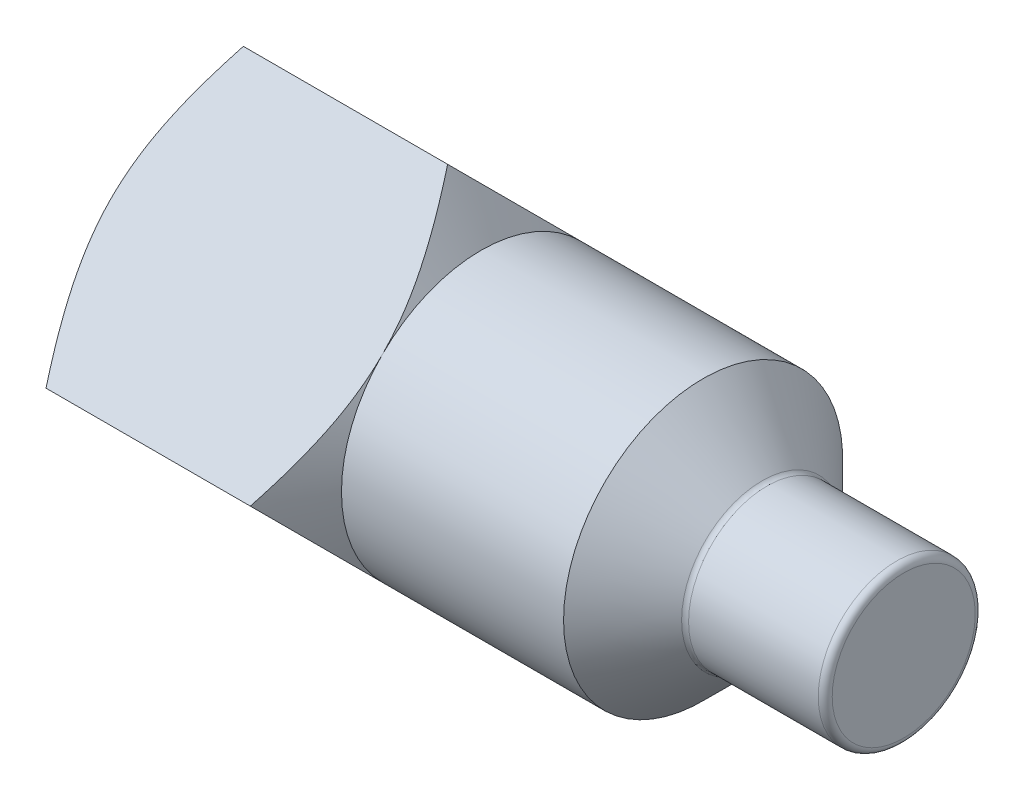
ISO-10303-21;
HEADER;
FILE_DESCRIPTION(('STEP AP214'),'2;1');
FILE_NAME('part.step','',(''),(''),'','','');
FILE_SCHEMA(('AUTOMOTIVE_DESIGN { 1 0 10303 214 1 1 1 1 }'));
ENDSEC;
DATA;
#1=APPLICATION_CONTEXT('core data for automotive mechanical design processes');
#2=APPLICATION_PROTOCOL_DEFINITION('international standard','automotive_design',2000,#1);
#3=PRODUCT_CONTEXT('',#1,'mechanical');
#4=PRODUCT('Part','Part','',(#3));
#5=PRODUCT_RELATED_PRODUCT_CATEGORY('part','',(#4));
#6=PRODUCT_DEFINITION_FORMATION('','',#4);
#7=PRODUCT_DEFINITION_CONTEXT('part definition',#1,'design');
#8=PRODUCT_DEFINITION('design','',#6,#7);
#9=PRODUCT_DEFINITION_SHAPE('','',#8);
#10=(LENGTH_UNIT() NAMED_UNIT(*) SI_UNIT(.MILLI.,.METRE.));
#11=(NAMED_UNIT(*) PLANE_ANGLE_UNIT() SI_UNIT($,.RADIAN.));
#12=(NAMED_UNIT(*) SI_UNIT($,.STERADIAN.) SOLID_ANGLE_UNIT());
#13=UNCERTAINTY_MEASURE_WITH_UNIT(LENGTH_MEASURE(1.E-05),#10,'distance_accuracy_value','');
#14=(GEOMETRIC_REPRESENTATION_CONTEXT(3) GLOBAL_UNCERTAINTY_ASSIGNED_CONTEXT((#13)) GLOBAL_UNIT_ASSIGNED_CONTEXT((#10,
#11,#12)) REPRESENTATION_CONTEXT('',''));
#15=CARTESIAN_POINT('',(0.,0.,0.));
#16=DIRECTION('',(0.,0.,1.));
#17=DIRECTION('',(1.,0.,0.));
#18=AXIS2_PLACEMENT_3D('',#15,#16,#17);
#19=CARTESIAN_POINT('',(0.,0.,0.));
#20=DIRECTION('',(-1.,0.,0.));
#21=DIRECTION('',(0.,0.,1.));
#22=AXIS2_PLACEMENT_3D('',#19,#20,#21);
#23=CYLINDRICAL_SURFACE('',#22,2.);
#24=CARTESIAN_POINT('',(3.94226497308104,0.,0.));
#25=DIRECTION('',(-1.,0.,0.));
#26=DIRECTION('',(0.,0.,1.));
#27=AXIS2_PLACEMENT_3D('',#24,#25,#26);
#28=CIRCLE('',#27,2.);
#29=CARTESIAN_POINT('',(3.9422649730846,1.41421356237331,1.41421356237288));
#30=VERTEX_POINT('',#29);
#31=CARTESIAN_POINT('',(3.94226497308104,1.41421356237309,-1.4142135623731));
#32=VERTEX_POINT('',#31);
#33=EDGE_CURVE('E53',#30,#32,#28,.T.);
#34=ORIENTED_EDGE('',*,*,#33,.F.);
#35=CARTESIAN_POINT('',(3.94226497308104,-1.41421356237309,1.4142135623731));
#36=VERTEX_POINT('',#35);
#37=EDGE_CURVE('E94',#36,#30,#28,.T.);
#38=ORIENTED_EDGE('',*,*,#37,.F.);
#39=CARTESIAN_POINT('',(3.94226497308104,-1.41421356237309,-1.4142135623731));
#40=VERTEX_POINT('',#39);
#41=EDGE_CURVE('E93',#40,#36,#28,.T.);
#42=ORIENTED_EDGE('',*,*,#41,.F.);
#43=EDGE_CURVE('E110',#32,#40,#28,.T.);
#44=ORIENTED_EDGE('',*,*,#43,.F.);
#45=EDGE_LOOP('',(#34,#38,#42,#44));
#46=FACE_BOUND('',#45,.T.);
#47=CARTESIAN_POINT('',(7.12499999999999,0.,0.));
#48=DIRECTION('',(-1.,0.,0.));
#49=DIRECTION('',(0.,0.,1.));
#50=AXIS2_PLACEMENT_3D('',#47,#48,#49);
#51=CIRCLE('',#50,2.);
#52=CARTESIAN_POINT('',(7.12499999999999,0.,2.));
#53=VERTEX_POINT('',#52);
#54=EDGE_CURVE('E165',#53,#53,#51,.T.);
#55=ORIENTED_EDGE('',*,*,#54,.T.);
#56=EDGE_LOOP('',(#55));
#57=FACE_BOUND('',#56,.T.);
#58=ADVANCED_FACE('F39',(#46,#57),#23,.T.);
#59=CARTESIAN_POINT('',(3.46397234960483,0.,0.));
#60=DIRECTION('',(-1.,0.,0.));
#61=DIRECTION('',(0.,0.,1.));
#62=AXIS2_PLACEMENT_3D('',#59,#60,#61);
#63=CONICAL_SURFACE('',#62,2.82842712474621,1.0471975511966);
#64=CARTESIAN_POINT('',(3.4638568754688,2.8286271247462,-0.000200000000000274));
#65=CARTESIAN_POINT('',(3.49161506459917,2.78053478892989,0.0478923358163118));
#66=CARTESIAN_POINT('',(3.51878504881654,2.7322683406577,0.0961587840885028));
#67=CARTESIAN_POINT('',(3.57167045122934,2.63532015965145,0.193106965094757));
#68=CARTESIAN_POINT('',(3.59738536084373,2.58663828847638,0.241788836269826));
#69=CARTESIAN_POINT('',(3.64721601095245,2.48852382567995,0.339903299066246));
#70=CARTESIAN_POINT('',(3.67132090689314,2.43908845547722,0.389338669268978));
#71=CARTESIAN_POINT('',(3.71737604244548,2.33972512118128,0.488702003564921));
#72=CARTESIAN_POINT('',(3.73932646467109,2.28979719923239,0.538629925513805));
#73=CARTESIAN_POINT('',(3.8006124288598,2.14090389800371,0.687523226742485));
#74=CARTESIAN_POINT('',(3.83626445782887,2.04114820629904,0.787278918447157));
#75=CARTESIAN_POINT('',(3.89354790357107,1.83980995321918,0.988617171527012));
#76=CARTESIAN_POINT('',(3.91521440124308,1.73823262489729,1.0901944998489));
#77=CARTESIAN_POINT('',(3.93895616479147,1.55061877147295,1.27780835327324));
#78=CARTESIAN_POINT('',(3.94365263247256,1.46475280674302,1.36367431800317));
#79=CARTESIAN_POINT('',(3.94015885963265,1.29311675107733,1.53531037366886));
#80=CARTESIAN_POINT('',(3.93196285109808,1.20734672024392,1.62108040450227));
#81=CARTESIAN_POINT('',(3.90378450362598,1.03666151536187,1.79176560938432));
#82=CARTESIAN_POINT('',(3.88378039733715,0.951748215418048,1.87667890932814));
#83=CARTESIAN_POINT('',(3.83421705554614,0.783348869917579,2.04507825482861));
#84=CARTESIAN_POINT('',(3.80465560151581,0.699863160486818,2.12856396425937));
#85=CARTESIAN_POINT('',(3.75037319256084,0.564467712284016,2.26395941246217));
#86=CARTESIAN_POINT('',(3.72780043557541,0.512114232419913,2.31631289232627));
#87=CARTESIAN_POINT('',(3.68024330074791,0.407975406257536,2.42045171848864));
#88=CARTESIAN_POINT('',(3.65525964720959,0.356189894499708,2.47223723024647));
#89=CARTESIAN_POINT('',(3.60344889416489,0.253386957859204,2.57504016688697));
#90=CARTESIAN_POINT('',(3.57663195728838,0.202366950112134,2.62606017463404));
#91=CARTESIAN_POINT('',(3.52137669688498,0.100767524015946,2.72765960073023));
#92=CARTESIAN_POINT('',(3.49293839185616,0.0501881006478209,2.77823902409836));
#93=CARTESIAN_POINT('',(3.46385687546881,-0.000200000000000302,2.82862712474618));
#94=B_SPLINE_CURVE_WITH_KNOTS('',3,(#64,#65,#66,#67,#68,#69,#70,#71,#72,#73,#74,#75,#76,#77,#78,
#79,#80,#81,#82,#83,#84,#85,#86,#87,#88,#89,#90,#91,#92,#93),.UNSPECIFIED.,.F.,.F.,(4,2,2,2,2,2,
2,2,2,2,2,2,2,2,4),(0.,0.220383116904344,0.440842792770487,0.662662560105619,0.884463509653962,
1.32047426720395,1.75538705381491,2.11928790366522,2.48335160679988,2.84808853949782,
3.21291019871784,3.4450819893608,3.67718424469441,3.90809048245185,4.13899408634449),.UNSPECIFIED.);
#95=CARTESIAN_POINT('',(3.46397234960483,2.82842712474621,0.));
#96=VERTEX_POINT('',#95);
#97=EDGE_CURVE('E118',#96,#30,#94,.T.);
#98=ORIENTED_EDGE('',*,*,#97,.T.);
#99=ORIENTED_EDGE('',*,*,#33,.T.);
#100=CARTESIAN_POINT('',(3.46385687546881,-0.000200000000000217,-2.82862712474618));
#101=CARTESIAN_POINT('',(3.49161506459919,0.0478923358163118,-2.78053478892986));
#102=CARTESIAN_POINT('',(3.51878504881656,0.0961587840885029,-2.73226834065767));
#103=CARTESIAN_POINT('',(3.57167045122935,0.193106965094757,-2.63532015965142));
#104=CARTESIAN_POINT('',(3.59738536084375,0.241788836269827,-2.58663828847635));
#105=CARTESIAN_POINT('',(3.64721601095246,0.339903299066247,-2.48852382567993));
#106=CARTESIAN_POINT('',(3.67132090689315,0.389338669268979,-2.4390884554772));
#107=CARTESIAN_POINT('',(3.71737604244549,0.488702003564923,-2.33972512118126));
#108=CARTESIAN_POINT('',(3.7393264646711,0.538629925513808,-2.28979719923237));
#109=CARTESIAN_POINT('',(3.80061242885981,0.687523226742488,-2.1409038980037));
#110=CARTESIAN_POINT('',(3.83626445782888,0.78727891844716,-2.04114820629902));
#111=CARTESIAN_POINT('',(3.89354790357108,0.988617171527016,-1.83980995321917));
#112=CARTESIAN_POINT('',(3.91521440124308,1.0901944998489,-1.73823262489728));
#113=CARTESIAN_POINT('',(3.93895616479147,1.27780835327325,-1.55061877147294));
#114=CARTESIAN_POINT('',(3.94365263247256,1.36367431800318,-1.46475280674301));
#115=CARTESIAN_POINT('',(3.94015885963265,1.53531037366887,-1.29311675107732));
#116=CARTESIAN_POINT('',(3.93196285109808,1.62108040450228,-1.20734672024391));
#117=CARTESIAN_POINT('',(3.90378450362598,1.79176560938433,-1.03666151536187));
#118=CARTESIAN_POINT('',(3.88378039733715,1.87667890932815,-0.951748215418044));
#119=CARTESIAN_POINT('',(3.83421705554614,2.04507825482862,-0.783348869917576));
#120=CARTESIAN_POINT('',(3.8046556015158,2.12856396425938,-0.699863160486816));
#121=CARTESIAN_POINT('',(3.75037319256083,2.26395941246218,-0.564467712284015));
#122=CARTESIAN_POINT('',(3.7278004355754,2.31631289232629,-0.512114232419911));
#123=CARTESIAN_POINT('',(3.6802433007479,2.42045171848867,-0.407975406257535));
#124=CARTESIAN_POINT('',(3.65525964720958,2.47223723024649,-0.356189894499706));
#125=CARTESIAN_POINT('',(3.60344889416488,2.575040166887,-0.253386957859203));
#126=CARTESIAN_POINT('',(3.57663195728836,2.62606017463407,-0.202366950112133));
#127=CARTESIAN_POINT('',(3.52137669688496,2.72765960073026,-0.100767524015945));
#128=CARTESIAN_POINT('',(3.49293839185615,2.77823902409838,-0.0501881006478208));
#129=CARTESIAN_POINT('',(3.4638568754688,2.8286271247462,0.000200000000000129));
#130=B_SPLINE_CURVE_WITH_KNOTS('',3,(#100,#101,#102,#103,#104,#105,#106,#107,#108,#109,#110,
#111,#112,#113,#114,#115,#116,#117,#118,#119,#120,#121,#122,#123,#124,#125,#126,#127,#128,#129),
.UNSPECIFIED.,.F.,.F.,(4,2,2,2,2,2,2,2,2,2,2,2,2,2,4),(0.,0.220383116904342,0.440842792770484,
0.662662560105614,0.884463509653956,1.32047426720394,1.75538705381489,2.11928790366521,
2.48335160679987,2.84808853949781,3.21291019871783,3.4450819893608,3.67718424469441,
3.90809048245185,4.13899408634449),.UNSPECIFIED.);
#131=EDGE_CURVE('E161',#32,#96,#130,.T.);
#132=ORIENTED_EDGE('',*,*,#131,.T.);
#133=EDGE_LOOP('',(#98,#99,#132));
#134=FACE_BOUND('',#133,.T.);
#135=ADVANCED_FACE('F142',(#134),#63,.T.);
#136=CARTESIAN_POINT('',(3.46397234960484,0.,-2.82842712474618));
#137=VERTEX_POINT('',#136);
#138=EDGE_CURVE('E154',#137,#32,#130,.T.);
#139=ORIENTED_EDGE('',*,*,#138,.T.);
#140=ORIENTED_EDGE('',*,*,#43,.T.);
#141=CARTESIAN_POINT('',(3.4638568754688,-2.8286271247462,0.000199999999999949));
#142=CARTESIAN_POINT('',(3.49161506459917,-2.78053478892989,-0.0478923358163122));
#143=CARTESIAN_POINT('',(3.51878504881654,-2.7322683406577,-0.0961587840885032));
#144=CARTESIAN_POINT('',(3.57167045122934,-2.63532015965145,-0.193106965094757));
#145=CARTESIAN_POINT('',(3.59738536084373,-2.58663828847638,-0.241788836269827));
#146=CARTESIAN_POINT('',(3.64721601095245,-2.48852382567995,-0.339903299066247));
#147=CARTESIAN_POINT('',(3.67132090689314,-2.43908845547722,-0.389338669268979));
#148=CARTESIAN_POINT('',(3.71737604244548,-2.33972512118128,-0.488702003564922));
#149=CARTESIAN_POINT('',(3.73932646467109,-2.28979719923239,-0.538629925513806));
#150=CARTESIAN_POINT('',(3.8006124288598,-2.14090389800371,-0.687523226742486));
#151=CARTESIAN_POINT('',(3.83626445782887,-2.04114820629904,-0.787278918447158));
#152=CARTESIAN_POINT('',(3.89354790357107,-1.83980995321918,-0.988617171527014));
#153=CARTESIAN_POINT('',(3.91521440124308,-1.73823262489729,-1.0901944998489));
#154=CARTESIAN_POINT('',(3.93895616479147,-1.55061877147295,-1.27780835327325));
#155=CARTESIAN_POINT('',(3.94365263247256,-1.46475280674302,-1.36367431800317));
#156=CARTESIAN_POINT('',(3.94015885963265,-1.29311675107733,-1.53531037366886));
#157=CARTESIAN_POINT('',(3.93196285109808,-1.20734672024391,-1.62108040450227));
#158=CARTESIAN_POINT('',(3.90378450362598,-1.03666151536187,-1.79176560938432));
#159=CARTESIAN_POINT('',(3.88378039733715,-0.951748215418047,-1.87667890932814));
#160=CARTESIAN_POINT('',(3.83421705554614,-0.783348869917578,-2.04507825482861));
#161=CARTESIAN_POINT('',(3.80465560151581,-0.699863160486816,-2.12856396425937));
#162=CARTESIAN_POINT('',(3.75037319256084,-0.564467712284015,-2.26395941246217));
#163=CARTESIAN_POINT('',(3.72780043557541,-0.512114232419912,-2.31631289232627));
#164=CARTESIAN_POINT('',(3.68024330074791,-0.407975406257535,-2.42045171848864));
#165=CARTESIAN_POINT('',(3.65525964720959,-0.356189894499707,-2.47223723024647));
#166=CARTESIAN_POINT('',(3.60344889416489,-0.253386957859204,-2.57504016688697));
#167=CARTESIAN_POINT('',(3.57663195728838,-0.202366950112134,-2.62606017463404));
#168=CARTESIAN_POINT('',(3.52137669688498,-0.100767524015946,-2.72765960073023));
#169=CARTESIAN_POINT('',(3.49293839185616,-0.0501881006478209,-2.77823902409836));
#170=CARTESIAN_POINT('',(3.46385687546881,0.000200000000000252,-2.82862712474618));
#171=B_SPLINE_CURVE_WITH_KNOTS('',3,(#141,#142,#143,#144,#145,#146,#147,#148,#149,#150,#151,
#152,#153,#154,#155,#156,#157,#158,#159,#160,#161,#162,#163,#164,#165,#166,#167,#168,#169,#170),
.UNSPECIFIED.,.F.,.F.,(4,2,2,2,2,2,2,2,2,2,2,2,2,2,4),(0.,0.220383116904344,0.440842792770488,
0.66266256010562,0.884463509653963,1.32047426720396,1.75538705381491,2.11928790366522,
2.48335160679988,2.84808853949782,3.21291019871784,3.44508198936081,3.67718424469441,
3.90809048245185,4.13899408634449),.UNSPECIFIED.);
#172=EDGE_CURVE('E64',#40,#137,#171,.T.);
#173=ORIENTED_EDGE('',*,*,#172,.T.);
#174=EDGE_LOOP('',(#139,#140,#173));
#175=FACE_BOUND('',#174,.T.);
#176=ADVANCED_FACE('F147',(#175),#63,.T.);
#177=CARTESIAN_POINT('',(3.46397234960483,-2.82842712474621,0.));
#178=VERTEX_POINT('',#177);
#179=EDGE_CURVE('E106',#178,#40,#171,.T.);
#180=ORIENTED_EDGE('',*,*,#179,.T.);
#181=ORIENTED_EDGE('',*,*,#41,.T.);
#182=CARTESIAN_POINT('',(3.46385687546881,0.000199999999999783,2.82862712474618));
#183=CARTESIAN_POINT('',(3.49161506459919,-0.0478923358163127,2.78053478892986));
#184=CARTESIAN_POINT('',(3.51878504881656,-0.0961587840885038,2.73226834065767));
#185=CARTESIAN_POINT('',(3.57167045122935,-0.193106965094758,2.63532015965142));
#186=CARTESIAN_POINT('',(3.59738536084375,-0.241788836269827,2.58663828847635));
#187=CARTESIAN_POINT('',(3.64721601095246,-0.339903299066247,2.48852382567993));
#188=CARTESIAN_POINT('',(3.67132090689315,-0.38933866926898,2.4390884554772));
#189=CARTESIAN_POINT('',(3.71737604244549,-0.488702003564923,2.33972512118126));
#190=CARTESIAN_POINT('',(3.7393264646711,-0.538629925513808,2.28979719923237));
#191=CARTESIAN_POINT('',(3.80061242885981,-0.687523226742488,2.1409038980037));
#192=CARTESIAN_POINT('',(3.83626445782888,-0.787278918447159,2.04114820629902));
#193=CARTESIAN_POINT('',(3.89354790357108,-0.988617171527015,1.83980995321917));
#194=CARTESIAN_POINT('',(3.91521440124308,-1.0901944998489,1.73823262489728));
#195=CARTESIAN_POINT('',(3.93895616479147,-1.27780835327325,1.55061877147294));
#196=CARTESIAN_POINT('',(3.94365263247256,-1.36367431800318,1.46475280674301));
#197=CARTESIAN_POINT('',(3.94015885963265,-1.53531037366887,1.29311675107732));
#198=CARTESIAN_POINT('',(3.93196285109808,-1.62108040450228,1.20734672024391));
#199=CARTESIAN_POINT('',(3.90378450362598,-1.79176560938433,1.03666151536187));
#200=CARTESIAN_POINT('',(3.88378039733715,-1.87667890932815,0.951748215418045));
#201=CARTESIAN_POINT('',(3.83421705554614,-2.04507825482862,0.783348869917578));
#202=CARTESIAN_POINT('',(3.8046556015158,-2.12856396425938,0.699863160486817));
#203=CARTESIAN_POINT('',(3.75037319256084,-2.26395941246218,0.564467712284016));
#204=CARTESIAN_POINT('',(3.7278004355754,-2.31631289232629,0.512114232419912));
#205=CARTESIAN_POINT('',(3.6802433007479,-2.42045171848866,0.407975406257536));
#206=CARTESIAN_POINT('',(3.65525964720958,-2.47223723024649,0.356189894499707));
#207=CARTESIAN_POINT('',(3.60344889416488,-2.575040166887,0.253386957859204));
#208=CARTESIAN_POINT('',(3.57663195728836,-2.62606017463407,0.202366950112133));
#209=CARTESIAN_POINT('',(3.52137669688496,-2.72765960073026,0.100767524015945));
#210=CARTESIAN_POINT('',(3.49293839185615,-2.77823902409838,0.0501881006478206));
#211=CARTESIAN_POINT('',(3.4638568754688,-2.8286271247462,-0.000200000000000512));
#212=B_SPLINE_CURVE_WITH_KNOTS('',3,(#182,#183,#184,#185,#186,#187,#188,#189,#190,#191,#192,
#193,#194,#195,#196,#197,#198,#199,#200,#201,#202,#203,#204,#205,#206,#207,#208,#209,#210,#211),
.UNSPECIFIED.,.F.,.F.,(4,2,2,2,2,2,2,2,2,2,2,2,2,2,4),(0.,0.220383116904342,0.440842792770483,
0.662662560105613,0.884463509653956,1.32047426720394,1.75538705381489,2.1192879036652,
2.48335160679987,2.8480885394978,3.21291019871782,3.4450819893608,3.67718424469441,
3.90809048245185,4.13899408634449),.UNSPECIFIED.);
#213=EDGE_CURVE('E104',#36,#178,#212,.T.);
#214=ORIENTED_EDGE('',*,*,#213,.T.);
#215=EDGE_LOOP('',(#180,#181,#214));
#216=FACE_BOUND('',#215,.T.);
#217=ADVANCED_FACE('F101',(#216),#63,.T.);
#218=CARTESIAN_POINT('',(3.46397234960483,0.,2.82842712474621));
#219=VERTEX_POINT('',#218);
#220=EDGE_CURVE('E115',#219,#36,#212,.T.);
#221=ORIENTED_EDGE('',*,*,#220,.T.);
#222=ORIENTED_EDGE('',*,*,#37,.T.);
#223=EDGE_CURVE('E117',#30,#219,#94,.T.);
#224=ORIENTED_EDGE('',*,*,#223,.T.);
#225=EDGE_LOOP('',(#221,#222,#224));
#226=FACE_BOUND('',#225,.T.);
#227=ADVANCED_FACE('F120',(#226),#63,.T.);
#228=CARTESIAN_POINT('',(4.,2.8284271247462,0.));
#229=DIRECTION('',(0.,-0.707106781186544,-0.707106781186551));
#230=DIRECTION('',(0.,0.707106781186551,-0.707106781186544));
#231=AXIS2_PLACEMENT_3D('',#228,#229,#230);
#232=PLANE('',#231);
#233=ORIENTED_EDGE('',*,*,#223,.F.);
#234=ORIENTED_EDGE('',*,*,#97,.F.);
#235=DIRECTION('',(-1.,0.,0.));
#236=VECTOR('',#235,1.);
#237=CARTESIAN_POINT('',(4.,2.8284271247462,0.));
#238=LINE('',#237,#236);
#239=CARTESIAN_POINT('',(0.536027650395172,2.8284271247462,0.));
#240=VERTEX_POINT('',#239);
#241=EDGE_CURVE('E205',#96,#240,#238,.T.);
#242=ORIENTED_EDGE('',*,*,#241,.T.);
#243=CARTESIAN_POINT('',(0.536143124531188,-0.000200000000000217,2.82862712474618));
#244=CARTESIAN_POINT('',(0.508384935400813,0.0478923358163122,2.78053478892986));
#245=CARTESIAN_POINT('',(0.481214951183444,0.0961587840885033,2.73226834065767));
#246=CARTESIAN_POINT('',(0.428329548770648,0.193106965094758,2.63532015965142));
#247=CARTESIAN_POINT('',(0.402614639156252,0.241788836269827,2.58663828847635));
#248=CARTESIAN_POINT('',(0.352783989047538,0.339903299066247,2.48852382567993));
#249=CARTESIAN_POINT('',(0.328679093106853,0.389338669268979,2.4390884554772));
#250=CARTESIAN_POINT('',(0.282623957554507,0.488702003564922,2.33972512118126));
#251=CARTESIAN_POINT('',(0.260673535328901,0.538629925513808,2.28979719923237));
#252=CARTESIAN_POINT('',(0.199387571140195,0.687523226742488,2.1409038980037));
#253=CARTESIAN_POINT('',(0.163735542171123,0.787278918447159,2.04114820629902));
#254=CARTESIAN_POINT('',(0.106452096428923,0.988617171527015,1.83980995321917));
#255=CARTESIAN_POINT('',(0.0847855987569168,1.0901944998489,1.73823262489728));
#256=CARTESIAN_POINT('',(0.0610438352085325,1.27780835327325,1.55061877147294));
#257=CARTESIAN_POINT('',(0.0563473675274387,1.36367431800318,1.46475280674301));
#258=CARTESIAN_POINT('',(0.0598411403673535,1.53531037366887,1.29311675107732));
#259=CARTESIAN_POINT('',(0.0680371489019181,1.62108040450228,1.20734672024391));
#260=CARTESIAN_POINT('',(0.0962154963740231,1.79176560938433,1.03666151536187));
#261=CARTESIAN_POINT('',(0.116219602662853,1.87667890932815,0.951748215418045));
#262=CARTESIAN_POINT('',(0.165782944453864,2.04507825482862,0.783348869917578));
#263=CARTESIAN_POINT('',(0.195344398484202,2.12856396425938,0.699863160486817));
#264=CARTESIAN_POINT('',(0.249626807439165,2.26395941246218,0.564467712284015));
#265=CARTESIAN_POINT('',(0.272199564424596,2.31631289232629,0.512114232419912));
#266=CARTESIAN_POINT('',(0.319756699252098,2.42045171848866,0.407975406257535));
#267=CARTESIAN_POINT('',(0.344740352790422,2.47223723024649,0.356189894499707));
#268=CARTESIAN_POINT('',(0.396551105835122,2.575040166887,0.253386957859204));
#269=CARTESIAN_POINT('',(0.423368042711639,2.62606017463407,0.202366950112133));
#270=CARTESIAN_POINT('',(0.478623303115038,2.72765960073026,0.100767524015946));
#271=CARTESIAN_POINT('',(0.507061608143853,2.77823902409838,0.050188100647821));
#272=CARTESIAN_POINT('',(0.536143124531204,2.8286271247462,-0.000200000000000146));
#273=B_SPLINE_CURVE_WITH_KNOTS('',3,(#243,#244,#245,#246,#247,#248,#249,#250,#251,#252,#253,
#254,#255,#256,#257,#258,#259,#260,#261,#262,#263,#264,#265,#266,#267,#268,#269,#270,#271,#272),
.UNSPECIFIED.,.F.,.F.,(4,2,2,2,2,2,2,2,2,2,2,2,2,2,4),(0.,0.220383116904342,0.440842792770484,
0.662662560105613,0.884463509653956,1.32047426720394,1.75538705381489,2.11928790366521,
2.48335160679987,2.8480885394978,3.21291019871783,3.4450819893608,3.67718424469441,
3.90809048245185,4.13899408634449),.UNSPECIFIED.);
#274=CARTESIAN_POINT('',(0.536027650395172,0.,2.8284271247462));
#275=VERTEX_POINT('',#274);
#276=EDGE_CURVE('E198',#275,#240,#273,.T.);
#277=ORIENTED_EDGE('',*,*,#276,.F.);
#278=DIRECTION('',(-1.,0.,0.));
#279=VECTOR('',#278,1.);
#280=CARTESIAN_POINT('',(4.,0.,2.82842712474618));
#281=LINE('',#280,#279);
#282=EDGE_CURVE('E96',#219,#275,#281,.T.);
#283=ORIENTED_EDGE('',*,*,#282,.F.);
#284=EDGE_LOOP('',(#233,#234,#242,#277,#283));
#285=FACE_BOUND('',#284,.T.);
#286=ADVANCED_FACE('F202',(#285),#232,.F.);
#287=CARTESIAN_POINT('',(4.,-2.8284271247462,0.));
#288=DIRECTION('',(0.,0.707106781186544,-0.707106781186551));
#289=DIRECTION('',(0.,0.707106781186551,0.707106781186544));
#290=AXIS2_PLACEMENT_3D('',#287,#288,#289);
#291=PLANE('',#290);
#292=ORIENTED_EDGE('',*,*,#213,.F.);
#293=ORIENTED_EDGE('',*,*,#220,.F.);
#294=ORIENTED_EDGE('',*,*,#282,.T.);
#295=CARTESIAN_POINT('',(0.536143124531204,-2.8286271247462,-0.000200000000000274));
#296=CARTESIAN_POINT('',(0.508384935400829,-2.78053478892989,0.0478923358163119));
#297=CARTESIAN_POINT('',(0.481214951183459,-2.7322683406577,0.0961587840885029));
#298=CARTESIAN_POINT('',(0.428329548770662,-2.63532015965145,0.193106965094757));
#299=CARTESIAN_POINT('',(0.402614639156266,-2.58663828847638,0.241788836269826));
#300=CARTESIAN_POINT('',(0.352783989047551,-2.48852382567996,0.339903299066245));
#301=CARTESIAN_POINT('',(0.328679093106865,-2.43908845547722,0.389338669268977));
#302=CARTESIAN_POINT('',(0.282623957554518,-2.33972512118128,0.48870200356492));
#303=CARTESIAN_POINT('',(0.260673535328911,-2.28979719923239,0.538629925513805));
#304=CARTESIAN_POINT('',(0.199387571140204,-2.14090389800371,0.687523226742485));
#305=CARTESIAN_POINT('',(0.16373554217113,-2.04114820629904,0.787278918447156));
#306=CARTESIAN_POINT('',(0.106452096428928,-1.83980995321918,0.988617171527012));
#307=CARTESIAN_POINT('',(0.0847855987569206,-1.73823262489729,1.0901944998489));
#308=CARTESIAN_POINT('',(0.0610438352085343,-1.55061877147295,1.27780835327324));
#309=CARTESIAN_POINT('',(0.0563473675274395,-1.46475280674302,1.36367431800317));
#310=CARTESIAN_POINT('',(0.0598411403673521,-1.29311675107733,1.53531037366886));
#311=CARTESIAN_POINT('',(0.0680371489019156,-1.20734672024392,1.62108040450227));
#312=CARTESIAN_POINT('',(0.0962154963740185,-1.03666151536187,1.79176560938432));
#313=CARTESIAN_POINT('',(0.116219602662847,-0.951748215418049,1.87667890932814));
#314=CARTESIAN_POINT('',(0.165782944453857,-0.78334886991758,2.0450782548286));
#315=CARTESIAN_POINT('',(0.195344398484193,-0.699863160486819,2.12856396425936));
#316=CARTESIAN_POINT('',(0.249626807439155,-0.564467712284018,2.26395941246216));
#317=CARTESIAN_POINT('',(0.272199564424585,-0.512114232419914,2.31631289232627));
#318=CARTESIAN_POINT('',(0.319756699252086,-0.407975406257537,2.42045171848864));
#319=CARTESIAN_POINT('',(0.34474035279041,-0.356189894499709,2.47223723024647));
#320=CARTESIAN_POINT('',(0.396551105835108,-0.253386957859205,2.57504016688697));
#321=CARTESIAN_POINT('',(0.423368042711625,-0.202366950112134,2.62606017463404));
#322=CARTESIAN_POINT('',(0.478623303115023,-0.100767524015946,2.72765960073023));
#323=CARTESIAN_POINT('',(0.507061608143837,-0.0501881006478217,2.77823902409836));
#324=CARTESIAN_POINT('',(0.536143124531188,0.000200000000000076,2.82862712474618));
#325=B_SPLINE_CURVE_WITH_KNOTS('',3,(#295,#296,#297,#298,#299,#300,#301,#302,#303,#304,#305,
#306,#307,#308,#309,#310,#311,#312,#313,#314,#315,#316,#317,#318,#319,#320,#321,#322,#323,#324),
.UNSPECIFIED.,.F.,.F.,(4,2,2,2,2,2,2,2,2,2,2,2,2,2,4),(0.,0.220383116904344,0.440842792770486,
0.662662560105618,0.884463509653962,1.32047426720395,1.75538705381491,2.11928790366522,
2.48335160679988,2.84808853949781,3.21291019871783,3.4450819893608,3.67718424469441,
3.90809048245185,4.13899408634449),.UNSPECIFIED.);
#326=CARTESIAN_POINT('',(0.536027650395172,-2.8284271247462,0.));
#327=VERTEX_POINT('',#326);
#328=EDGE_CURVE('E186',#327,#275,#325,.T.);
#329=ORIENTED_EDGE('',*,*,#328,.F.);
#330=DIRECTION('',(-1.,0.,0.));
#331=VECTOR('',#330,1.);
#332=CARTESIAN_POINT('',(4.,-2.8284271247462,0.));
#333=LINE('',#332,#331);
#334=EDGE_CURVE('E114',#178,#327,#333,.T.);
#335=ORIENTED_EDGE('',*,*,#334,.F.);
#336=EDGE_LOOP('',(#292,#293,#294,#329,#335));
#337=FACE_BOUND('',#336,.T.);
#338=ADVANCED_FACE('F111',(#337),#291,.F.);
#339=CARTESIAN_POINT('',(4.,-2.8284271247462,0.));
#340=DIRECTION('',(0.,0.707106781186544,0.707106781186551));
#341=DIRECTION('',(0.,-0.707106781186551,0.707106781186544));
#342=AXIS2_PLACEMENT_3D('',#339,#340,#341);
#343=PLANE('',#342);
#344=ORIENTED_EDGE('',*,*,#172,.F.);
#345=ORIENTED_EDGE('',*,*,#179,.F.);
#346=ORIENTED_EDGE('',*,*,#334,.T.);
#347=CARTESIAN_POINT('',(0.536143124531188,0.000199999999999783,-2.82862712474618));
#348=CARTESIAN_POINT('',(0.508384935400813,-0.0478923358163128,-2.78053478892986));
#349=CARTESIAN_POINT('',(0.481214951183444,-0.0961587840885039,-2.73226834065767));
#350=CARTESIAN_POINT('',(0.428329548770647,-0.193106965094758,-2.63532015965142));
#351=CARTESIAN_POINT('',(0.402614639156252,-0.241788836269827,-2.58663828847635));
#352=CARTESIAN_POINT('',(0.352783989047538,-0.339903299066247,-2.48852382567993));
#353=CARTESIAN_POINT('',(0.328679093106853,-0.38933866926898,-2.4390884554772));
#354=CARTESIAN_POINT('',(0.282623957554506,-0.488702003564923,-2.33972512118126));
#355=CARTESIAN_POINT('',(0.2606735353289,-0.538629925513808,-2.28979719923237));
#356=CARTESIAN_POINT('',(0.199387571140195,-0.687523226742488,-2.1409038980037));
#357=CARTESIAN_POINT('',(0.163735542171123,-0.787278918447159,-2.04114820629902));
#358=CARTESIAN_POINT('',(0.106452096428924,-0.988617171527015,-1.83980995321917));
#359=CARTESIAN_POINT('',(0.0847855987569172,-1.0901944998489,-1.73823262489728));
#360=CARTESIAN_POINT('',(0.0610438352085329,-1.27780835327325,-1.55061877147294));
#361=CARTESIAN_POINT('',(0.0563473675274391,-1.36367431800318,-1.46475280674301));
#362=CARTESIAN_POINT('',(0.0598411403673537,-1.53531037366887,-1.29311675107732));
#363=CARTESIAN_POINT('',(0.0680371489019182,-1.62108040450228,-1.20734672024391));
#364=CARTESIAN_POINT('',(0.0962154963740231,-1.79176560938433,-1.03666151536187));
#365=CARTESIAN_POINT('',(0.116219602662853,-1.87667890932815,-0.951748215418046));
#366=CARTESIAN_POINT('',(0.165782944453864,-2.04507825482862,-0.783348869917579));
#367=CARTESIAN_POINT('',(0.195344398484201,-2.12856396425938,-0.699863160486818));
#368=CARTESIAN_POINT('',(0.249626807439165,-2.26395941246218,-0.564467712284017));
#369=CARTESIAN_POINT('',(0.272199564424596,-2.31631289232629,-0.512114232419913));
#370=CARTESIAN_POINT('',(0.319756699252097,-2.42045171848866,-0.407975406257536));
#371=CARTESIAN_POINT('',(0.344740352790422,-2.47223723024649,-0.356189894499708));
#372=CARTESIAN_POINT('',(0.396551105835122,-2.575040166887,-0.253386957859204));
#373=CARTESIAN_POINT('',(0.423368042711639,-2.62606017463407,-0.202366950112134));
#374=CARTESIAN_POINT('',(0.478623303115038,-2.72765960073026,-0.100767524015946));
#375=CARTESIAN_POINT('',(0.507061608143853,-2.77823902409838,-0.0501881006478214));
#376=CARTESIAN_POINT('',(0.536143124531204,-2.8286271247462,0.000199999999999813));
#377=B_SPLINE_CURVE_WITH_KNOTS('',3,(#347,#348,#349,#350,#351,#352,#353,#354,#355,#356,#357,
#358,#359,#360,#361,#362,#363,#364,#365,#366,#367,#368,#369,#370,#371,#372,#373,#374,#375,#376),
.UNSPECIFIED.,.F.,.F.,(4,2,2,2,2,2,2,2,2,2,2,2,2,2,4),(0.,0.220383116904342,0.440842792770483,
0.662662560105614,0.884463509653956,1.32047426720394,1.75538705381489,2.1192879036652,
2.48335160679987,2.8480885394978,3.21291019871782,3.4450819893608,3.6771842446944,
3.90809048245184,4.13899408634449),.UNSPECIFIED.);
#378=CARTESIAN_POINT('',(0.536027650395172,0.,-2.8284271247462));
#379=VERTEX_POINT('',#378);
#380=EDGE_CURVE('E181',#379,#327,#377,.T.);
#381=ORIENTED_EDGE('',*,*,#380,.F.);
#382=DIRECTION('',(-1.,0.,0.));
#383=VECTOR('',#382,1.);
#384=CARTESIAN_POINT('',(4.,0.,-2.82842712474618));
#385=LINE('',#384,#383);
#386=EDGE_CURVE('E246',#137,#379,#385,.T.);
#387=ORIENTED_EDGE('',*,*,#386,.F.);
#388=EDGE_LOOP('',(#344,#345,#346,#381,#387));
#389=FACE_BOUND('',#388,.T.);
#390=ADVANCED_FACE('F166',(#389),#343,.F.);
#391=CARTESIAN_POINT('',(4.,2.8284271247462,0.));
#392=DIRECTION('',(0.,-0.707106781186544,0.707106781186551));
#393=DIRECTION('',(0.,-0.707106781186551,-0.707106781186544));
#394=AXIS2_PLACEMENT_3D('',#391,#392,#393);
#395=PLANE('',#394);
#396=ORIENTED_EDGE('',*,*,#131,.F.);
#397=ORIENTED_EDGE('',*,*,#138,.F.);
#398=ORIENTED_EDGE('',*,*,#386,.T.);
#399=CARTESIAN_POINT('',(0.536143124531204,2.8286271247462,0.000199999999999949));
#400=CARTESIAN_POINT('',(0.508384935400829,2.78053478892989,-0.0478923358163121));
#401=CARTESIAN_POINT('',(0.481214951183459,2.7322683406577,-0.0961587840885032));
#402=CARTESIAN_POINT('',(0.428329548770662,2.63532015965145,-0.193106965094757));
#403=CARTESIAN_POINT('',(0.402614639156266,2.58663828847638,-0.241788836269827));
#404=CARTESIAN_POINT('',(0.352783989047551,2.48852382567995,-0.339903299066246));
#405=CARTESIAN_POINT('',(0.328679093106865,2.43908845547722,-0.389338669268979));
#406=CARTESIAN_POINT('',(0.282623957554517,2.33972512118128,-0.488702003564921));
#407=CARTESIAN_POINT('',(0.260673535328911,2.28979719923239,-0.538629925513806));
#408=CARTESIAN_POINT('',(0.199387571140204,2.14090389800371,-0.687523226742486));
#409=CARTESIAN_POINT('',(0.16373554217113,2.04114820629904,-0.787278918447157));
#410=CARTESIAN_POINT('',(0.106452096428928,1.83980995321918,-0.988617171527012));
#411=CARTESIAN_POINT('',(0.0847855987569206,1.73823262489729,-1.0901944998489));
#412=CARTESIAN_POINT('',(0.0610438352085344,1.55061877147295,-1.27780835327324));
#413=CARTESIAN_POINT('',(0.0563473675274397,1.46475280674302,-1.36367431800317));
#414=CARTESIAN_POINT('',(0.0598411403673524,1.29311675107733,-1.53531037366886));
#415=CARTESIAN_POINT('',(0.0680371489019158,1.20734672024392,-1.62108040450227));
#416=CARTESIAN_POINT('',(0.0962154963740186,1.03666151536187,-1.79176560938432));
#417=CARTESIAN_POINT('',(0.116219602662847,0.951748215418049,-1.87667890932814));
#418=CARTESIAN_POINT('',(0.165782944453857,0.783348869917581,-2.0450782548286));
#419=CARTESIAN_POINT('',(0.195344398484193,0.69986316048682,-2.12856396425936));
#420=CARTESIAN_POINT('',(0.249626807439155,0.564467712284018,-2.26395941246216));
#421=CARTESIAN_POINT('',(0.272199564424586,0.512114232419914,-2.31631289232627));
#422=CARTESIAN_POINT('',(0.319756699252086,0.407975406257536,-2.42045171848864));
#423=CARTESIAN_POINT('',(0.34474035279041,0.356189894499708,-2.47223723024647));
#424=CARTESIAN_POINT('',(0.396551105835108,0.253386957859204,-2.57504016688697));
#425=CARTESIAN_POINT('',(0.423368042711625,0.202366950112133,-2.62606017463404));
#426=CARTESIAN_POINT('',(0.478623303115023,0.100767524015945,-2.72765960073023));
#427=CARTESIAN_POINT('',(0.507061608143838,0.0501881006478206,-2.77823902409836));
#428=CARTESIAN_POINT('',(0.536143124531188,-0.000200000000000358,-2.82862712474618));
#429=B_SPLINE_CURVE_WITH_KNOTS('',3,(#399,#400,#401,#402,#403,#404,#405,#406,#407,#408,#409,
#410,#411,#412,#413,#414,#415,#416,#417,#418,#419,#420,#421,#422,#423,#424,#425,#426,#427,#428),
.UNSPECIFIED.,.F.,.F.,(4,2,2,2,2,2,2,2,2,2,2,2,2,2,4),(0.,0.220383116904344,0.440842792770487,
0.662662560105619,0.884463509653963,1.32047426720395,1.75538705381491,2.11928790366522,
2.48335160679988,2.84808853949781,3.21291019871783,3.4450819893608,3.67718424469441,
3.90809048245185,4.13899408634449),.UNSPECIFIED.);
#430=EDGE_CURVE('E172',#240,#379,#429,.T.);
#431=ORIENTED_EDGE('',*,*,#430,.F.);
#432=ORIENTED_EDGE('',*,*,#241,.F.);
#433=EDGE_LOOP('',(#396,#397,#398,#431,#432));
#434=FACE_BOUND('',#433,.T.);
#435=ADVANCED_FACE('F164',(#434),#395,.F.);
#436=CARTESIAN_POINT('',(0.,0.,0.));
#437=DIRECTION('',(1.,0.,0.));
#438=DIRECTION('',(0.,0.,-1.));
#439=AXIS2_PLACEMENT_3D('',#436,#437,#438);
#440=CONICAL_SURFACE('',#439,1.9,1.0471975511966);
#441=CARTESIAN_POINT('',(0.,0.,0.));
#442=DIRECTION('',(-1.,0.,0.));
#443=DIRECTION('',(0.,0.,1.));
#444=AXIS2_PLACEMENT_3D('',#441,#442,#443);
#445=CIRCLE('',#444,1.9);
#446=CARTESIAN_POINT('',(0.,0.,1.9));
#447=VERTEX_POINT('',#446);
#448=EDGE_CURVE('E185',#447,#447,#445,.T.);
#449=ORIENTED_EDGE('',*,*,#448,.F.);
#450=EDGE_LOOP('',(#449));
#451=FACE_BOUND('',#450,.T.);
#452=ORIENTED_EDGE('',*,*,#276,.T.);
#453=ORIENTED_EDGE('',*,*,#430,.T.);
#454=ORIENTED_EDGE('',*,*,#380,.T.);
#455=ORIENTED_EDGE('',*,*,#328,.T.);
#456=EDGE_LOOP('',(#452,#453,#454,#455));
#457=FACE_BOUND('',#456,.T.);
#458=ADVANCED_FACE('F148',(#451,#457),#440,.T.);
#459=CARTESIAN_POINT('',(0.,0.,2.82842712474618));
#460=DIRECTION('',(-1.,0.,0.));
#461=DIRECTION('',(0.,0.,1.));
#462=AXIS2_PLACEMENT_3D('',#459,#460,#461);
#463=PLANE('',#462);
#464=ORIENTED_EDGE('',*,*,#448,.T.);
#465=EDGE_LOOP('',(#464));
#466=FACE_BOUND('',#465,.T.);
#467=ADVANCED_FACE('F167',(#466),#463,.T.);
#468=CARTESIAN_POINT('',(7.12499999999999,0.,0.));
#469=DIRECTION('',(-1.,0.,0.));
#470=DIRECTION('',(0.,0.,1.));
#471=AXIS2_PLACEMENT_3D('',#468,#469,#470);
#472=CONICAL_SURFACE('',#471,2.,0.785398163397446);
#473=CARTESIAN_POINT('',(7.97071067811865,0.,0.));
#474=DIRECTION('',(1.,0.,0.));
#475=DIRECTION('',(0.,0.,-1.));
#476=AXIS2_PLACEMENT_3D('',#473,#474,#475);
#477=CIRCLE('',#476,1.15428932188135);
#478=CARTESIAN_POINT('',(7.97071067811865,0.,-1.15428932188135));
#479=VERTEX_POINT('',#478);
#480=EDGE_CURVE('E11',#479,#479,#477,.F.);
#481=ORIENTED_EDGE('',*,*,#480,.T.);
#482=EDGE_LOOP('',(#481));
#483=FACE_BOUND('',#482,.T.);
#484=ORIENTED_EDGE('',*,*,#54,.F.);
#485=EDGE_LOOP('',(#484));
#486=FACE_BOUND('',#485,.T.);
#487=ADVANCED_FACE('F226',(#483,#486),#472,.T.);
#488=CARTESIAN_POINT('',(10.,1.125,0.));
#489=DIRECTION('',(-1.,0.,0.));
#490=DIRECTION('',(0.,0.,1.));
#491=AXIS2_PLACEMENT_3D('',#488,#489,#490);
#492=PLANE('',#491);
#493=CARTESIAN_POINT('',(10.,0.,0.));
#494=DIRECTION('',(-1.,0.,0.));
#495=DIRECTION('',(0.,0.,1.));
#496=AXIS2_PLACEMENT_3D('',#493,#494,#495);
#497=CIRCLE('',#496,1.025);
#498=CARTESIAN_POINT('',(10.,0.,1.025));
#499=VERTEX_POINT('',#498);
#500=EDGE_CURVE('E50',#499,#499,#497,.F.);
#501=ORIENTED_EDGE('',*,*,#500,.T.);
#502=EDGE_LOOP('',(#501));
#503=FACE_BOUND('',#502,.T.);
#504=ADVANCED_FACE('F150',(#503),#492,.F.);
#505=CARTESIAN_POINT('',(0.,0.,0.));
#506=DIRECTION('',(-1.,0.,0.));
#507=DIRECTION('',(0.,0.,1.));
#508=AXIS2_PLACEMENT_3D('',#505,#506,#507);
#509=CYLINDRICAL_SURFACE('',#508,1.125);
#510=CARTESIAN_POINT('',(9.9,0.,0.));
#511=DIRECTION('',(-1.,0.,0.));
#512=DIRECTION('',(0.,0.,1.));
#513=AXIS2_PLACEMENT_3D('',#510,#511,#512);
#514=CIRCLE('',#513,1.125);
#515=CARTESIAN_POINT('',(9.9,0.,1.125));
#516=VERTEX_POINT('',#515);
#517=EDGE_CURVE('E251',#516,#516,#514,.T.);
#518=ORIENTED_EDGE('',*,*,#517,.T.);
#519=EDGE_LOOP('',(#518));
#520=FACE_BOUND('',#519,.T.);
#521=CARTESIAN_POINT('',(8.04142135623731,0.,0.));
#522=DIRECTION('',(-1.,0.,0.));
#523=DIRECTION('',(0.,0.,1.));
#524=AXIS2_PLACEMENT_3D('',#521,#522,#523);
#525=CIRCLE('',#524,1.125);
#526=CARTESIAN_POINT('',(8.04142135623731,0.,1.125));
#527=VERTEX_POINT('',#526);
#528=EDGE_CURVE('E252',#527,#527,#525,.F.);
#529=ORIENTED_EDGE('',*,*,#528,.T.);
#530=EDGE_LOOP('',(#529));
#531=FACE_BOUND('',#530,.T.);
#532=ADVANCED_FACE('F214',(#520,#531),#509,.T.);
#533=CARTESIAN_POINT('',(9.9,0.,0.));
#534=DIRECTION('',(-1.,0.,0.));
#535=DIRECTION('',(0.,0.,1.));
#536=AXIS2_PLACEMENT_3D('',#533,#534,#535);
#537=TOROIDAL_SURFACE('',#536,1.025,0.1);
#538=ORIENTED_EDGE('',*,*,#500,.F.);
#539=EDGE_LOOP('',(#538));
#540=FACE_BOUND('',#539,.T.);
#541=ORIENTED_EDGE('',*,*,#517,.F.);
#542=EDGE_LOOP('',(#541));
#543=FACE_BOUND('',#542,.T.);
#544=ADVANCED_FACE('F209',(#540,#543),#537,.T.);
#545=CARTESIAN_POINT('',(8.04142135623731,0.,0.));
#546=DIRECTION('',(-1.,0.,0.));
#547=DIRECTION('',(0.,0.,1.));
#548=AXIS2_PLACEMENT_3D('',#545,#546,#547);
#549=TOROIDAL_SURFACE('',#548,1.225,0.1);
#550=ORIENTED_EDGE('',*,*,#528,.F.);
#551=EDGE_LOOP('',(#550));
#552=FACE_BOUND('',#551,.T.);
#553=ORIENTED_EDGE('',*,*,#480,.F.);
#554=EDGE_LOOP('',(#553));
#555=FACE_BOUND('',#554,.T.);
#556=ADVANCED_FACE('F41',(#552,#555),#549,.F.);
#557=CLOSED_SHELL('',(#58,#135,#176,#217,#227,#286,#338,#390,#435,#458,#467,#487,#504,#532,#544,#556));
#558=MANIFOLD_SOLID_BREP('B2',#557);
#559=ADVANCED_BREP_SHAPE_REPRESENTATION('',(#18,#558),#14);
#560=SHAPE_DEFINITION_REPRESENTATION(#9,#559);
ENDSEC;
END-ISO-10303-21;
